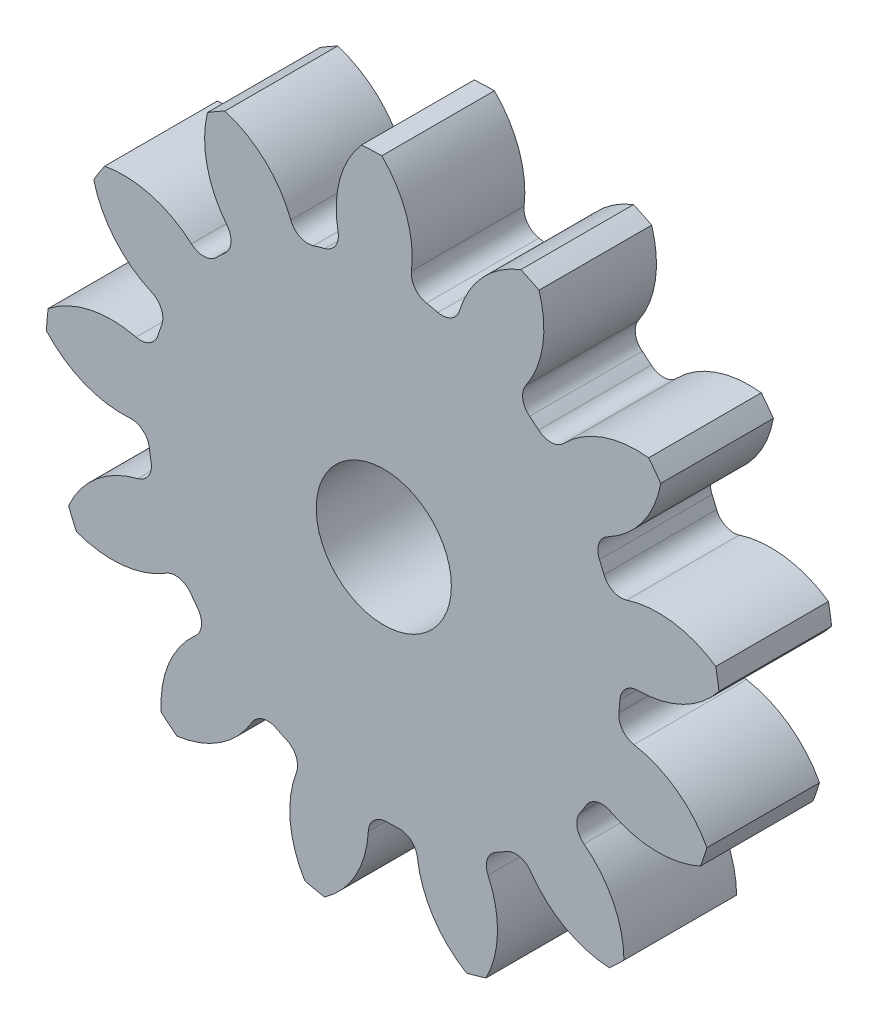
from build123d import *

# Parameters (mm, degrees)
SKETCH3_R         = 381
GEARBODY_DEPTH    = 127
TOOTHCUT_DEPTH    = 554.58016583
CIRPATTERN1_COUNT = 13
BOREDIA_R         = 76.2
BORE_DEPTH        = 12700


with BuildPart() as part:
    # Sketch3 → gearBody (new body)
    with BuildSketch(Plane.XY):
        Circle(SKETCH3_R)
    extrude(amount=GEARBODY_DEPTH)

    # Sketch2 → toothCut (cut, through all)
    with BuildSketch(Plane.XY):
        with BuildLine():
            ThreePointArc((265.095330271, -29.212255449), (265.737016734, -22.643496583), (266.215962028, -16.060870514))
            ThreePointArc((266.215962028, -16.060870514), (272.670899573, -2.262066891), (286.825666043, 3.369610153))
            ThreePointArc((286.825666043, 3.369610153), (339.875692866, 16.371727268), (381, 52.318239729))
            ThreePointArc((381, 52.318239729), (383.186747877, -32.651408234), (366.655351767, -116.026079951))
            ThreePointArc((366.655351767, -116.026079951), (332.205786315, -73.639904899), (282.120427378, -51.849603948))
            ThreePointArc((282.120427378, -51.849603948), (269.122562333, -43.904246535), (265.095330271, -29.212255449))
        make_face()
    toothcut = extrude(amount=TOOTHCUT_DEPTH, mode=Mode.SUBTRACT)

    # CirPattern1: toothCut ×13 about axis
    cirpattern1_axis = Axis((0, 0, 0), (0, 0, 1))
    for i in range(1, CIRPATTERN1_COUNT):
        add(toothcut.rotate(cirpattern1_axis, i * 360 / CIRPATTERN1_COUNT), mode=Mode.SUBTRACT)

    # boreDia → bore (cut, symmetric)
    with BuildSketch(Plane.XY):
        Circle(BOREDIA_R)
    extrude(amount=BORE_DEPTH, both=True, mode=Mode.SUBTRACT)


solid = part.part
